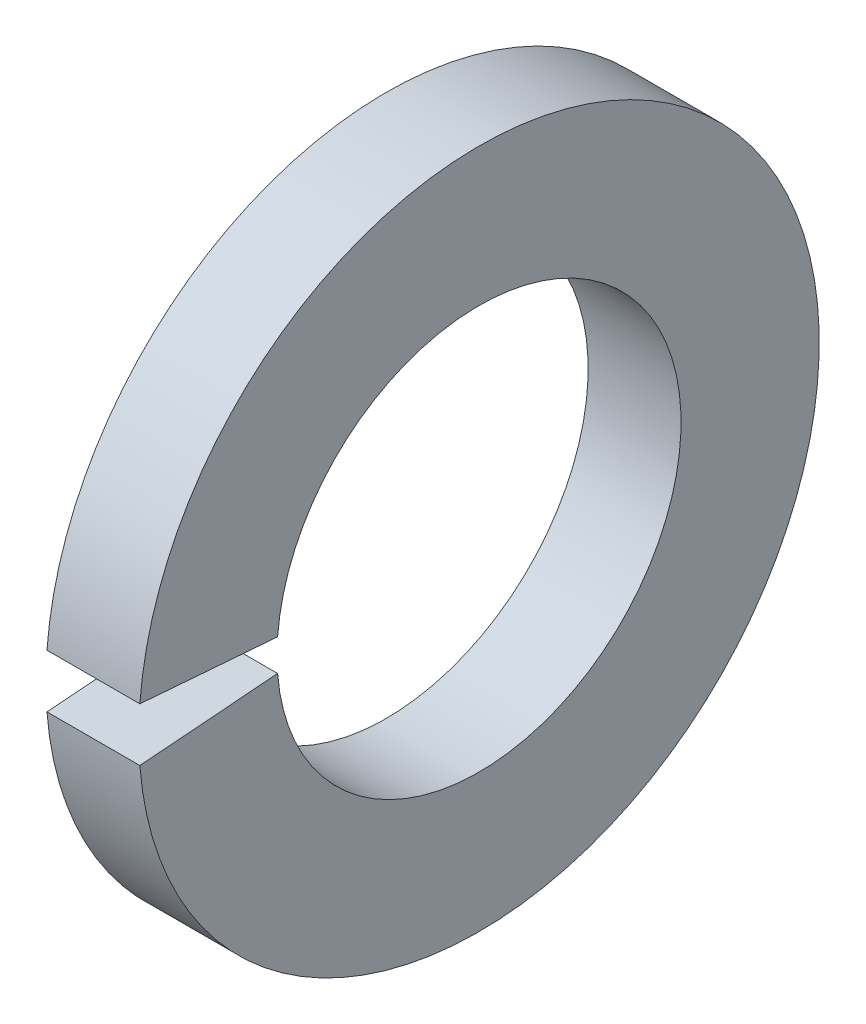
from build123d import *

# Parameters (mm, degrees)
SKETCH1_W = 1.016
SKETCH1_H = 1.5113
GAP_DEPTH = 6.359610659


with BuildPart() as part:
    # Sketch1 → Base-Revolve (revolve)
    with BuildSketch(Plane.XY, mode=Mode.PRIVATE) as base_revolve_sk:
        with Locations((-0.508, 2.96545)):
            Rectangle(SKETCH1_W, SKETCH1_H)
    revolve(base_revolve_sk.sketch.rotate(Axis((-34.925, 0, 0), (1, 0, 0)), 90), axis=Axis((-34.925, 0, 0), (1, 0, 0)))

    # Sketch2 → Gap (cut, through all)
    with BuildSketch(Plane(origin=(0, 0, 0), x_dir=(0, -1, 0), z_dir=(-1, 0, 0))):
        with BuildLine():
            Line((0, 0), (0.297793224, 3.783821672))
            ThreePointArc((0.297793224, 3.783821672), (0, 3.795522), (-0.297793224, 3.783821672))
            Line((-0.297793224, 3.783821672), (0, 0))
        make_face()
    extrude(amount=GAP_DEPTH, mode=Mode.SUBTRACT)


solid = part.part
